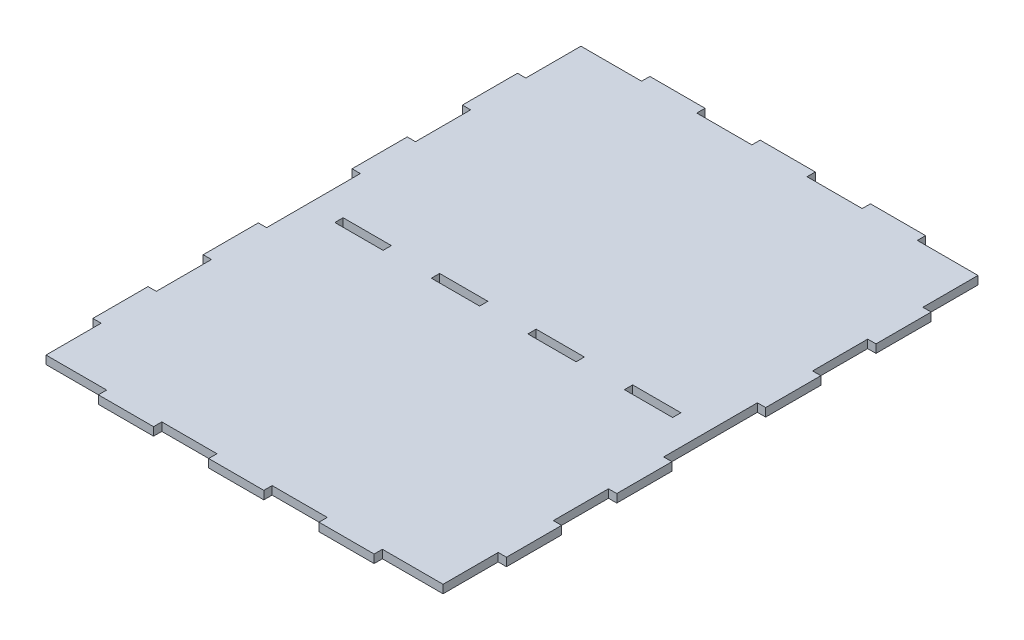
from build123d import *

# Parameters (mm, degrees)
SKETCH1_W           = 600
SKETCH1_H           = 800
BOSS_EXTRUDE1_DEPTH = 12
SKETCH2_W           = 12
SKETCH2_H           = 136
SKETCH2_W_2         = 80
SKETCH2_H_2         = 12
SKETCH2_H_3         = 80
CUT_EXTRUDE1_DEPTH  = 12
SKETCH3_W           = 70
SKETCH3_H           = 12
CUT_EXTRUDE2_DEPTH  = 12


with BuildPart() as part:
    # Sketch1 → Boss-Extrude1 (new body)
    with BuildSketch(Plane(origin=(0, 0, 0), x_dir=(1, 0, 0), z_dir=(0, 1, 0))):
        with Locations((300, 400)):
            Rectangle(SKETCH1_W, SKETCH1_H)
    extrude(amount=BOSS_EXTRUDE1_DEPTH)

    # Sketch2 → Cut-Extrude1 (cut)
    with BuildSketch(Plane(origin=(0, 12, 0), x_dir=(1, 0, 0), z_dir=(0, 1, 0))):
        with Locations((594, 400)):
            Rectangle(SKETCH2_W, SKETCH2_H)
        Polygon((0, 0), (100, 0), (100, 12), (12, 12), (12, 92), (0, 92), (0, 12), align=None)
        with Locations((220, 6)):
            Rectangle(SKETCH2_W_2, SKETCH2_H_2)
        Polygon((600, 800), (600, 788), (600, 708), (588, 708), (588, 788), (500, 788), (500, 800), align=None)
        with Locations((380, 6)):
            Rectangle(SKETCH2_W_2, SKETCH2_H_2)
        Polygon((500, 0), (600, 0), (600, 12), (600, 92), (588, 92), (588, 12), (500, 12), align=None)
        with Locations((380, 794)):
            Rectangle(SKETCH2_W_2, SKETCH2_H_2)
        with Locations((220, 794)):
            Rectangle(SKETCH2_W_2, SKETCH2_H_2)
        Polygon((100, 800), (100, 788), (12, 788), (12, 708), (0, 708), (0, 788), (0, 800), align=None)
        with Locations((6, 212)):
            Rectangle(SKETCH2_W, SKETCH2_H_3)
        with Locations((6, 400)):
            Rectangle(SKETCH2_W, SKETCH2_H)
        with Locations((594, 212)):
            Rectangle(SKETCH2_W, SKETCH2_H_3)
        with Locations((594, 588)):
            Rectangle(SKETCH2_W, SKETCH2_H_3)
        with Locations((6, 588)):
            Rectangle(SKETCH2_W, SKETCH2_H_3)
    extrude(amount=-CUT_EXTRUDE1_DEPTH, mode=Mode.SUBTRACT)

    # Sketch3 → Cut-Extrude2 (cut)
    with BuildSketch(Plane(origin=(0, 12, 0), x_dir=(1, 0, 0), z_dir=(0, 1, 0))):
        with Locations((90, 394)):
            Rectangle(SKETCH3_W, SKETCH3_H)
        with Locations((230, 394)):
            Rectangle(SKETCH3_W, SKETCH3_H)
        with Locations((370, 394)):
            Rectangle(SKETCH3_W, SKETCH3_H)
        with Locations((510, 394)):
            Rectangle(SKETCH3_W, SKETCH3_H)
    extrude(amount=-CUT_EXTRUDE2_DEPTH, mode=Mode.SUBTRACT)


solid = part.part
